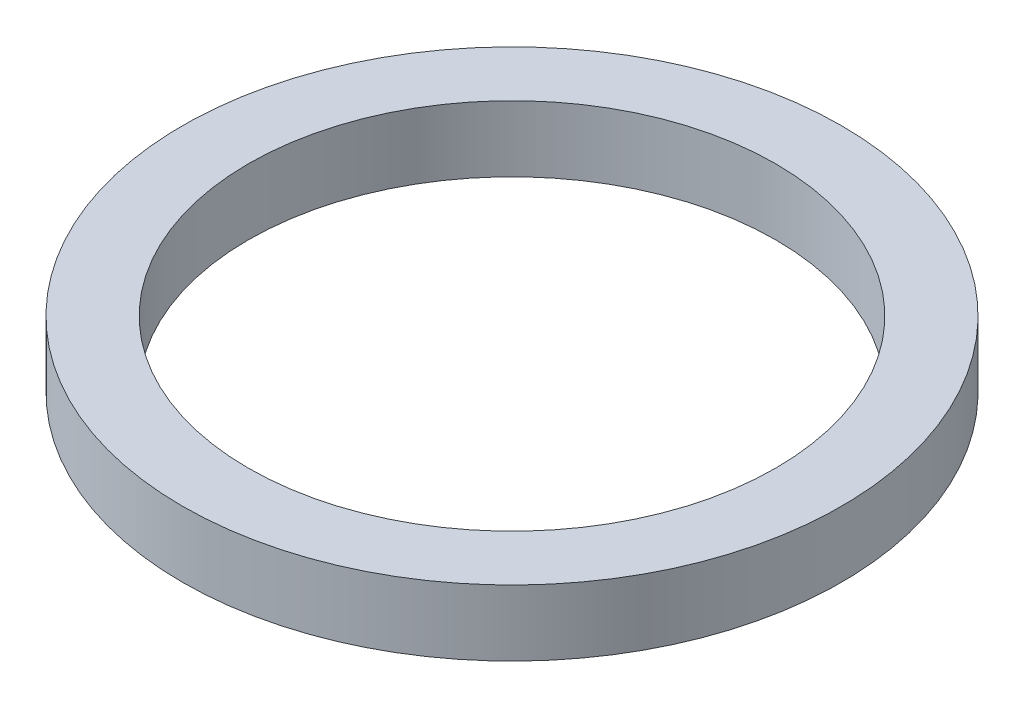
from build123d import *

# Parameters (mm, degrees)
SKETCH1_R           = 50
SKETCH1_R_2         = 40
BOSS_EXTRUDE1_DEPTH = 10


with BuildPart() as part:
    # Sketch1 → Boss-Extrude1 (new body)
    with BuildSketch(Plane(origin=(0, 0, 0), x_dir=(1, 0, 0), z_dir=(0, 1, 0))):
        with Locations(Location((0, 0, 0), (0, 0, 270))):
            Circle(SKETCH1_R)
        with Locations(Location((0, 0, 0), (0, 0, 270))):
            Circle(SKETCH1_R_2, mode=Mode.SUBTRACT)
    extrude(amount=BOSS_EXTRUDE1_DEPTH)


solid = part.part
